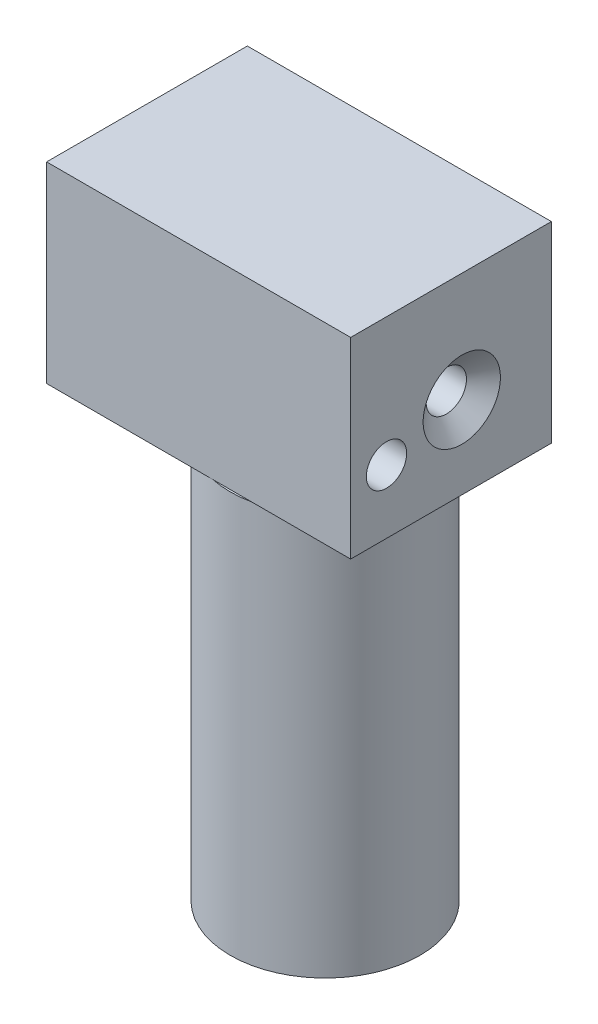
from build123d import *

# Parameters (mm, degrees)
SKETCH1_W                                          = 38.476420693
SKETCH1_H                                          = 24.294406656
EXTRUDE1_DEPTH                                     = 25.4
SKETCH4_R                                          = 12.00130834
EXTRUDE2_DEPTH                                     = 50.8
CSK_FOR_10_FLAT_HEAD_MACHINE_SCREW_100_D           = 5.1054
CSK_FOR_10_FLAT_HEAD_MACHINE_SCREW_100_CSINK_D     = 9.779
CSK_FOR_10_FLAT_HEAD_MACHINE_SCREW_100_CSINK_ANGLE = 100
F_1_4_20_TAPPED_HOLE1_D                            = 5.1054
F_1_4_20_TAPPED_HOLE1_DEPTH                        = 19.05
F_1_4_20_TAPPED_HOLE1_TIP                          = 1.533816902


with BuildPart() as part:
    # Sketch1 → Extrude1 (new body)
    with BuildSketch(Plane.XY):
        with Locations((10.502131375, 6.702504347)):
            Rectangle(SKETCH1_W, SKETCH1_H)
    extrude(amount=EXTRUDE1_DEPTH)

    # Sketch4 → Extrude2 (add)
    with BuildSketch(Plane.XZ.offset(5.444698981)):
        with Locations(Location((14.761565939, 13.655497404, 0), (0, 0, 78.125832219))):
            Circle(SKETCH4_R)
    extrude(amount=EXTRUDE2_DEPTH)

    # CSK for _10 Flat Head Machine Screw _100 (through all)
    with Locations(Plane(origin=(29.740341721, 0, 0), x_dir=(0, 0, -1), z_dir=(1, 0, 0))):
        with Locations((-11.336112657, 4.988192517)):
            CounterSinkHole(CSK_FOR_10_FLAT_HEAD_MACHINE_SCREW_100_D / 2, CSK_FOR_10_FLAT_HEAD_MACHINE_SCREW_100_CSINK_D / 2, counter_sink_angle=CSK_FOR_10_FLAT_HEAD_MACHINE_SCREW_100_CSINK_ANGLE)

    # 1_4-20 Tapped Hole1
    with Locations(Plane(origin=(29.740341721, 0, 0), x_dir=(0, 0, -1), z_dir=(1, 0, 0))):
        with Locations((-20.861112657, 2.606942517)):
            Hole(F_1_4_20_TAPPED_HOLE1_D / 2, depth=F_1_4_20_TAPPED_HOLE1_DEPTH)
            with Locations((0, 0, -(F_1_4_20_TAPPED_HOLE1_DEPTH + F_1_4_20_TAPPED_HOLE1_TIP / 2))):  # 118° drill point
                Cone(0, F_1_4_20_TAPPED_HOLE1_D / 2, F_1_4_20_TAPPED_HOLE1_TIP, mode=Mode.SUBTRACT)


solid = part.part
